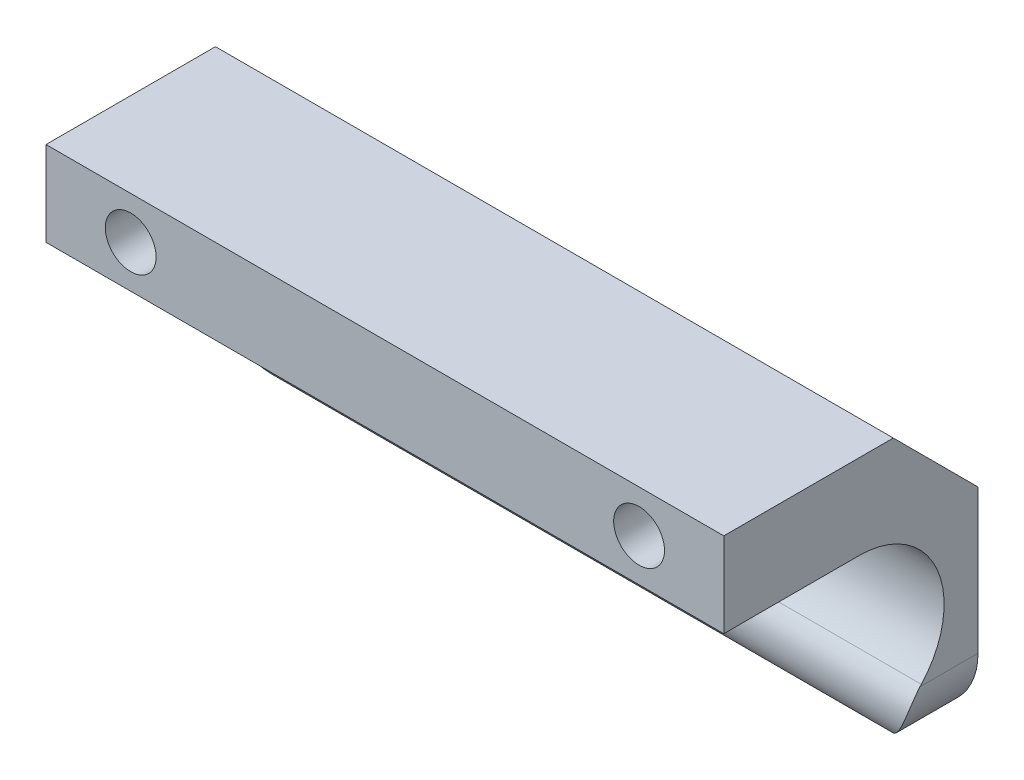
from build123d import *

# Parameters (mm, degrees)
SKETCH1_W      = 30
SKETCH1_H      = 35
EXTRUDE1_DEPTH = 40
CHAMFER1_SIZE  = 10
EXTRUDE2_DEPTH = 80
EXTRUDE3_DEPTH = 53.974050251


with BuildPart() as part:
    # Sketch1 → Extrude1 (new, symmetric)
    with BuildSketch(Plane(origin=(0, 0, 0), x_dir=(0, 0, -1), z_dir=(1, 0, 0))):
        Rectangle(SKETCH1_W, SKETCH1_H)
    extrude(amount=EXTRUDE1_DEPTH, both=True)

    # Chamfer1
    chamfer1_edges = [part.edges().sort_by_distance(p)[0] for p in [
        (0, 17.5, -15),
    ]]
    chamfer(chamfer1_edges, length=CHAMFER1_SIZE)

    # Sketch2 → Extrude2 (cut)
    with BuildSketch(Plane(origin=(40, 0, 0), x_dir=(0, 0, -1), z_dir=(1, 0, 0))):
        with BuildLine():
            ThreePointArc((8.30782305, -9.326105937), (10.172269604, 1.483650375), (1, 7.5))
            Line((1, 7.5), (-15, 7.5))
            Line((-15, 7.5), (-15, -17.5))
            Line((-15, -17.5), (11.857864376, -17.5))
            ThreePointArc((11.857864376, -17.5), (7.4021002, -14.577338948), (8.30782305, -9.326105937))
        make_face()
        with BuildLine():
            ThreePointArc((15, -16.346974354), (13.531370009, -17.202642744), (11.857864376, -17.5))
            Line((11.857864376, -17.5), (15, -17.5))
            Line((15, -17.5), (15, -16.346974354))
        make_face()
    extrude(amount=-EXTRUDE2_DEPTH, mode=Mode.SUBTRACT)

    # Sketch3 → Extrude3 (cut, through all)
    with BuildSketch(Plane(origin=(0, 0, -15), x_dir=(-1, 0, 0), z_dir=(0, 0, -1))):
        with BuildLine():
            Line((-40, -17.5), (-40, -9.5))
            ThreePointArc((-40, -9.5), (-37.656854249, -15.156854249), (-32, -17.5))
            Line((-32, -17.5), (-40, -17.5))
        make_face()
        with BuildLine():
            Line((40, -17.5), (40, -9.5))
            ThreePointArc((40, -9.5), (37.656854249, -15.156854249), (32, -17.5))
            Line((32, -17.5), (40, -17.5))
        make_face()
    extrude(amount=-EXTRUDE3_DEPTH, mode=Mode.SUBTRACT)

    # Sketch4 → M6x1.0 Tapped Hole1 (revolve, cut)
    with BuildSketch(Plane(origin=(-30, 12.5, 15), x_dir=(0, -1, 0), z_dir=(1, 0, 0))):
        Polygon((0, 0), (0, 18.502151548), (2.5, 17), (2.5, 12), (3, 12), (3, 0), align=None)
    m6x1_0_tapped_hole1 = revolve(axis=Axis((-30, 12.5, 21.35), (0, 0, -1)), mode=Mode.SUBTRACT)

    # Mirror1: M6x1.0 Tapped Hole1 across plane
    add(m6x1_0_tapped_hole1.mirror(Plane(origin=(0, 0, 0), x_dir=(0, 0, 1), z_dir=(1, 0, 0))), mode=Mode.SUBTRACT)


solid = part.part
